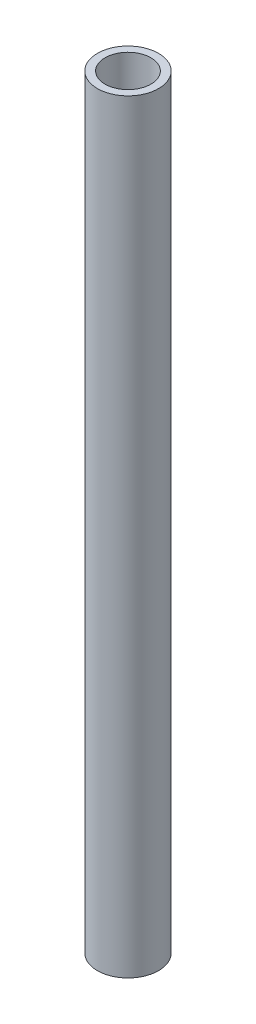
from build123d import *

# Parameters (mm, degrees)
SKETCH_1_R      = 4
SKETCH_1_R_2    = 3
EXTRUDE_1_DEPTH = 100


with BuildPart() as part:
    # Sketch 1 → Extrude 1 (new body)
    with BuildSketch(Plane(origin=(0, 0, 0), x_dir=(1, 0, 0), z_dir=(0, 1, 0))):
        with Locations(Location((0, 0, 0), (0, 0, 270))):
            Circle(SKETCH_1_R)
        with Locations(Location((0, 0, 0), (0, 0, 270))):
            Circle(SKETCH_1_R_2, mode=Mode.SUBTRACT)
    extrude(amount=EXTRUDE_1_DEPTH)


solid = part.part
